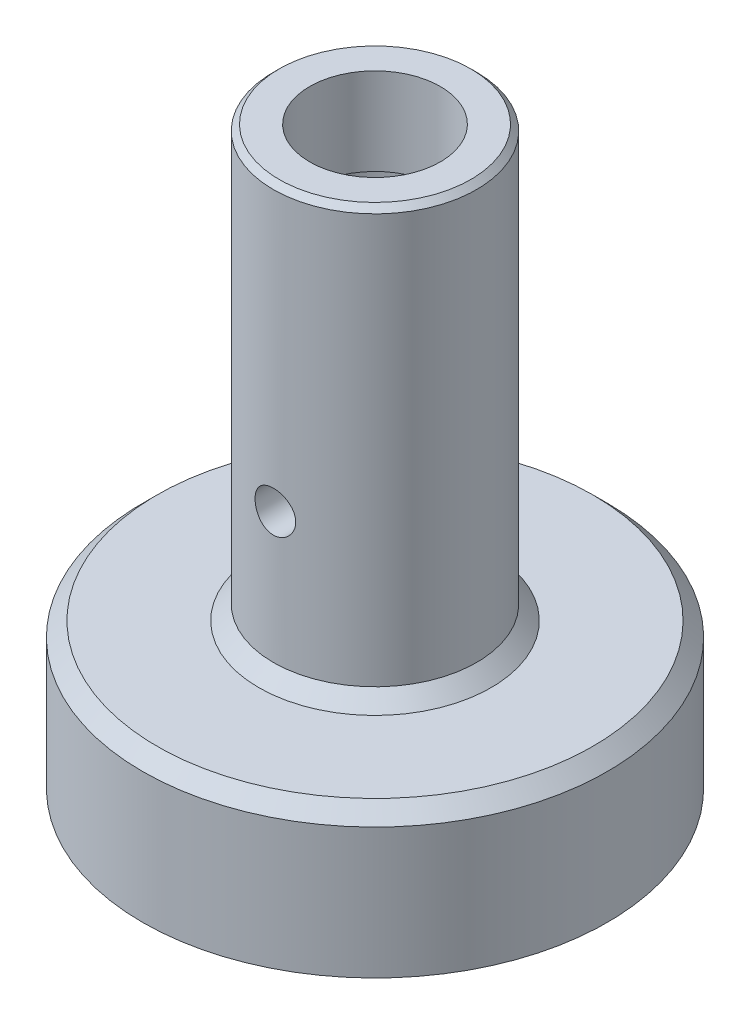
ISO-10303-21;
HEADER;
FILE_DESCRIPTION(('STEP AP214'),'2;1');
FILE_NAME('part.step','',(''),(''),'','','');
FILE_SCHEMA(('AUTOMOTIVE_DESIGN { 1 0 10303 214 1 1 1 1 }'));
ENDSEC;
DATA;
#1=APPLICATION_CONTEXT('core data for automotive mechanical design processes');
#2=APPLICATION_PROTOCOL_DEFINITION('international standard','automotive_design',2000,#1);
#3=PRODUCT_CONTEXT('',#1,'mechanical');
#4=PRODUCT('Part','Part','',(#3));
#5=PRODUCT_RELATED_PRODUCT_CATEGORY('part','',(#4));
#6=PRODUCT_DEFINITION_FORMATION('','',#4);
#7=PRODUCT_DEFINITION_CONTEXT('part definition',#1,'design');
#8=PRODUCT_DEFINITION('design','',#6,#7);
#9=PRODUCT_DEFINITION_SHAPE('','',#8);
#10=(LENGTH_UNIT() NAMED_UNIT(*) SI_UNIT(.MILLI.,.METRE.));
#11=(NAMED_UNIT(*) PLANE_ANGLE_UNIT() SI_UNIT($,.RADIAN.));
#12=(NAMED_UNIT(*) SI_UNIT($,.STERADIAN.) SOLID_ANGLE_UNIT());
#13=UNCERTAINTY_MEASURE_WITH_UNIT(LENGTH_MEASURE(1.E-05),#10,'distance_accuracy_value','');
#14=(GEOMETRIC_REPRESENTATION_CONTEXT(3) GLOBAL_UNCERTAINTY_ASSIGNED_CONTEXT((#13)) GLOBAL_UNIT_ASSIGNED_CONTEXT((#10,
#11,#12)) REPRESENTATION_CONTEXT('',''));
#15=CARTESIAN_POINT('',(0.,0.,0.));
#16=DIRECTION('',(0.,0.,1.));
#17=DIRECTION('',(1.,0.,0.));
#18=AXIS2_PLACEMENT_3D('',#15,#16,#17);
#19=CARTESIAN_POINT('',(0.,66.7925189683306,0.));
#20=DIRECTION('',(0.,1.,0.));
#21=DIRECTION('',(0.,0.,1.));
#22=AXIS2_PLACEMENT_3D('',#19,#20,#21);
#23=CYLINDRICAL_SURFACE('',#22,25.);
#24=CARTESIAN_POINT('',(0.,-30.,0.));
#25=DIRECTION('',(0.,1.,0.));
#26=DIRECTION('',(0.,0.,1.));
#27=AXIS2_PLACEMENT_3D('',#24,#25,#26);
#28=CIRCLE('',#27,25.);
#29=CARTESIAN_POINT('',(0.,-30.,25.));
#30=VERTEX_POINT('',#29);
#31=EDGE_CURVE('E66',#30,#30,#28,.T.);
#32=ORIENTED_EDGE('',*,*,#31,.T.);
#33=EDGE_LOOP('',(#32));
#34=FACE_BOUND('',#33,.T.);
#35=CARTESIAN_POINT('',(0.,-176.,0.));
#36=DIRECTION('',(0.,1.,0.));
#37=DIRECTION('',(0.,0.,1.));
#38=AXIS2_PLACEMENT_3D('',#35,#36,#37);
#39=CIRCLE('',#38,25.);
#40=CARTESIAN_POINT('',(0.,-176.,25.));
#41=VERTEX_POINT('',#40);
#42=EDGE_CURVE('E10',#41,#41,#39,.F.);
#43=ORIENTED_EDGE('',*,*,#42,.T.);
#44=EDGE_LOOP('',(#43));
#45=FACE_BOUND('',#44,.T.);
#46=CARTESIAN_POINT('',(0.,-105.,25.));
#47=CARTESIAN_POINT('',(-0.192641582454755,-105.000007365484,25.0000048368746));
#48=CARTESIAN_POINT('',(-0.385209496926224,-104.992047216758,24.9977704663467));
#49=CARTESIAN_POINT('',(-0.768985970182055,-104.960294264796,24.9889060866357));
#50=CARTESIAN_POINT('',(-0.960194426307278,-104.93650027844,24.982275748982));
#51=CARTESIAN_POINT('',(-1.33983267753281,-104.873274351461,24.9647949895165));
#52=CARTESIAN_POINT('',(-1.52826199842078,-104.833839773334,24.9539438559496));
#53=CARTESIAN_POINT('',(-1.90105420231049,-104.739656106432,24.9283154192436));
#54=CARTESIAN_POINT('',(-2.08541555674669,-104.684901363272,24.9135366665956));
#55=CARTESIAN_POINT('',(-2.44840649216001,-104.560643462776,24.8804836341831));
#56=CARTESIAN_POINT('',(-2.62704559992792,-104.491166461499,24.8622155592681));
#57=CARTESIAN_POINT('',(-2.97781048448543,-104.337925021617,24.8226472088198));
#58=CARTESIAN_POINT('',(-3.14993382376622,-104.254155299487,24.8013458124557));
#59=CARTESIAN_POINT('',(-3.48645233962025,-104.072984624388,24.7562810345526));
#60=CARTESIAN_POINT('',(-3.65084991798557,-103.975587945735,24.7325184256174));
#61=CARTESIAN_POINT('',(-3.97097457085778,-103.767826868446,24.6831449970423));
#62=CARTESIAN_POINT('',(-4.12669829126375,-103.657457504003,24.6575334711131));
#63=CARTESIAN_POINT('',(-4.58613327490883,-103.302742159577,24.5777371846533));
#64=CARTESIAN_POINT('',(-4.87470196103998,-103.038772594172,24.5216246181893));
#65=CARTESIAN_POINT('',(-5.40404439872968,-102.466350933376,24.4104443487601));
#66=CARTESIAN_POINT('',(-5.64481130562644,-102.157892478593,24.3553767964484));
#67=CARTESIAN_POINT('',(-5.96725766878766,-101.664905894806,24.2776517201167));
#68=CARTESIAN_POINT('',(-6.06909441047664,-101.493683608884,24.2523314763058));
#69=CARTESIAN_POINT('',(-6.25792635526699,-101.142923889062,24.2042940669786));
#70=CARTESIAN_POINT('',(-6.34492739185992,-100.963389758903,24.1815758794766));
#71=CARTESIAN_POINT('',(-6.50341953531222,-100.597184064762,24.1394338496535));
#72=CARTESIAN_POINT('',(-6.57490685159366,-100.410510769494,24.1200108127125));
#73=CARTESIAN_POINT('',(-6.70171757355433,-100.031475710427,24.0850848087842));
#74=CARTESIAN_POINT('',(-6.75704789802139,-99.8391164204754,24.0695801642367));
#75=CARTESIAN_POINT('',(-6.84993811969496,-99.4548105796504,24.0433072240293));
#76=CARTESIAN_POINT('',(-6.88789752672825,-99.2629677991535,24.0324328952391));
#77=CARTESIAN_POINT('',(-6.94763745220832,-98.8766517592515,24.0152306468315));
#78=CARTESIAN_POINT('',(-6.96942437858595,-98.6821795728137,24.0089009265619));
#79=CARTESIAN_POINT('',(-6.99664103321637,-98.2919954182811,24.0009836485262));
#80=CARTESIAN_POINT('',(-7.00207059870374,-98.096283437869,23.9993961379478));
#81=CARTESIAN_POINT('',(-6.99652065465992,-97.7051141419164,24.0010147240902));
#82=CARTESIAN_POINT('',(-6.98554144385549,-97.5096568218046,24.0042207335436));
#83=CARTESIAN_POINT('',(-6.94787685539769,-97.1265647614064,24.015148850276));
#84=CARTESIAN_POINT('',(-6.92169271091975,-96.938876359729,24.0227267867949));
#85=CARTESIAN_POINT('',(-6.85423822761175,-96.5663838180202,24.0420599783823));
#86=CARTESIAN_POINT('',(-6.81296274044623,-96.3815806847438,24.0538166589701));
#87=CARTESIAN_POINT('',(-6.71568625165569,-96.0162454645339,24.0811566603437));
#88=CARTESIAN_POINT('',(-6.65968969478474,-95.8357121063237,24.0967388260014));
#89=CARTESIAN_POINT('',(-6.53338774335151,-95.4799834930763,24.1312894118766));
#90=CARTESIAN_POINT('',(-6.46307696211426,-95.3047902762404,24.1502591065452));
#91=CARTESIAN_POINT('',(-6.30777219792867,-94.958885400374,24.1912904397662));
#92=CARTESIAN_POINT('',(-6.22261388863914,-94.7882515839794,24.2133860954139));
#93=CARTESIAN_POINT('',(-6.0387893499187,-94.4546787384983,24.2598847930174));
#94=CARTESIAN_POINT('',(-5.94011848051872,-94.2917423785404,24.2842886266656));
#95=CARTESIAN_POINT('',(-5.72996540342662,-93.9746205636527,24.3347317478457));
#96=CARTESIAN_POINT('',(-5.61848308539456,-93.8204351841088,24.3607710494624));
#97=CARTESIAN_POINT('',(-5.38343075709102,-93.5217422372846,24.4137908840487));
#98=CARTESIAN_POINT('',(-5.25986045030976,-93.3772349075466,24.4407714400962));
#99=CARTESIAN_POINT('',(-4.99670237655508,-93.0937060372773,24.4959524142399));
#100=CARTESIAN_POINT('',(-4.8566957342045,-92.9550746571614,24.5241615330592));
#101=CARTESIAN_POINT('',(-4.56548871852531,-92.6900984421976,24.580038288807));
#102=CARTESIAN_POINT('',(-4.41429201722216,-92.5637496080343,24.6077060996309));
#103=CARTESIAN_POINT('',(-4.10157168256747,-92.3240919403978,24.6617577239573));
#104=CARTESIAN_POINT('',(-3.94004368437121,-92.2107886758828,24.688140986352));
#105=CARTESIAN_POINT('',(-3.60783553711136,-91.9981333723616,24.7388710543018));
#106=CARTESIAN_POINT('',(-3.43715899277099,-91.8987758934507,24.7632186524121));
#107=CARTESIAN_POINT('',(-3.08674710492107,-91.714188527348,24.8093407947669));
#108=CARTESIAN_POINT('',(-2.90696623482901,-91.6290411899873,24.8311001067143));
#109=CARTESIAN_POINT('',(-2.54055533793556,-91.4742728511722,24.8712590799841));
#110=CARTESIAN_POINT('',(-2.35392792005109,-91.4046460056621,24.8896600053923));
#111=CARTESIAN_POINT('',(-1.97510428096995,-91.2814710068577,24.9225822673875));
#112=CARTESIAN_POINT('',(-1.78290808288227,-91.2279227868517,24.9371036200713));
#113=CARTESIAN_POINT('',(-1.39438339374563,-91.1373854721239,24.9618424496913));
#114=CARTESIAN_POINT('',(-1.19805503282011,-91.1003958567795,24.9720600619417));
#115=CARTESIAN_POINT('',(-0.809028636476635,-91.0442205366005,24.9876402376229));
#116=CARTESIAN_POINT('',(-0.616412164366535,-91.0245087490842,24.9931461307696));
#117=CARTESIAN_POINT('',(-0.230133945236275,-91.0011089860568,24.9996869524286));
#118=CARTESIAN_POINT('',(-0.0364722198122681,-90.9974206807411,25.000721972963));
#119=CARTESIAN_POINT('',(0.350441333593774,-91.00610035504,24.9982922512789));
#120=CARTESIAN_POINT('',(0.543693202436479,-91.0184666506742,24.9948279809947));
#121=CARTESIAN_POINT('',(0.928379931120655,-91.0591412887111,24.9834973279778));
#122=CARTESIAN_POINT('',(1.1198148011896,-91.0874495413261,24.9756309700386));
#123=CARTESIAN_POINT('',(1.49577857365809,-91.1590532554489,24.9559090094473));
#124=CARTESIAN_POINT('',(1.68036937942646,-91.2020465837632,24.9441339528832));
#125=CARTESIAN_POINT('',(2.04526565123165,-91.3027822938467,24.9168692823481));
#126=CARTESIAN_POINT('',(2.22556965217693,-91.3605296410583,24.9013784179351));
#127=CARTESIAN_POINT('',(2.58058397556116,-91.4902921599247,24.8670944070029));
#128=CARTESIAN_POINT('',(2.75529581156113,-91.5623034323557,24.8483021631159));
#129=CARTESIAN_POINT('',(3.0981243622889,-91.7200917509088,24.8078905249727));
#130=CARTESIAN_POINT('',(3.26623856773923,-91.8058739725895,24.7862700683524));
#131=CARTESIAN_POINT('',(3.59816233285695,-91.9924861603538,24.7402885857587));
#132=CARTESIAN_POINT('',(3.76181102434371,-92.0935905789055,24.7158801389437));
#133=CARTESIAN_POINT('',(4.08011150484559,-92.3088126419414,24.6653334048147));
#134=CARTESIAN_POINT('',(4.23476015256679,-92.4229347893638,24.6391945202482));
#135=CARTESIAN_POINT('',(4.53405202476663,-92.663407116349,24.5858797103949));
#136=CARTESIAN_POINT('',(4.67869501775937,-92.789757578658,24.5587037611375));
#137=CARTESIAN_POINT('',(4.95708489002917,-93.0538776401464,24.5040289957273));
#138=CARTESIAN_POINT('',(5.09083159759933,-93.1916474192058,24.4765301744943));
#139=CARTESIAN_POINT('',(5.35063368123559,-93.4822687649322,24.4210752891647));
#140=CARTESIAN_POINT('',(5.47631328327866,-93.6354590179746,24.3931321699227));
#141=CARTESIAN_POINT('',(5.71429075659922,-93.9520276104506,24.3384836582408));
#142=CARTESIAN_POINT('',(5.82659317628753,-94.1154024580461,24.3117778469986));
#143=CARTESIAN_POINT('',(6.03710305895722,-94.4513807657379,24.2603614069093));
#144=CARTESIAN_POINT('',(6.13530536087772,-94.6239875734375,24.2356515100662));
#145=CARTESIAN_POINT('',(6.31678429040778,-94.9771482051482,24.1889854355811));
#146=CARTESIAN_POINT('',(6.40006698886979,-95.1576987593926,24.1670281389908));
#147=CARTESIAN_POINT('',(6.55069471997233,-95.5246163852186,24.126633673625));
#148=CARTESIAN_POINT('',(6.61811962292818,-95.7109487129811,24.1081789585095));
#149=CARTESIAN_POINT('',(6.7369845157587,-96.0889092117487,24.0752330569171));
#150=CARTESIAN_POINT('',(6.78843079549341,-96.2805352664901,24.0607403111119));
#151=CARTESIAN_POINT('',(6.87491079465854,-96.6677280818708,24.0361732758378));
#152=CARTESIAN_POINT('',(6.90994524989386,-96.8632946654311,24.0260987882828));
#153=CARTESIAN_POINT('',(6.96327565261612,-97.2568803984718,24.0106969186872));
#154=CARTESIAN_POINT('',(6.98157213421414,-97.4548994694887,24.0053693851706));
#155=CARTESIAN_POINT('',(7.00089410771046,-97.8446078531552,23.9997411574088));
#156=CARTESIAN_POINT('',(7.00252465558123,-98.0362648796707,23.9992643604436));
#157=CARTESIAN_POINT('',(6.99006805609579,-98.4190912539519,24.0028954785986));
#158=CARTESIAN_POINT('',(6.97597551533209,-98.610260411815,24.0070049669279));
#159=CARTESIAN_POINT('',(6.93219935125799,-98.9905743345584,24.0196821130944));
#160=CARTESIAN_POINT('',(6.90252205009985,-99.1797198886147,24.0282479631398));
#161=CARTESIAN_POINT('',(6.82782649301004,-99.5547871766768,24.0495798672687));
#162=CARTESIAN_POINT('',(6.78280251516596,-99.7407076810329,24.0623474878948));
#163=CARTESIAN_POINT('',(6.67831208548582,-100.106160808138,24.0915557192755));
#164=CARTESIAN_POINT('',(6.61899152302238,-100.285738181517,24.107959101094));
#165=CARTESIAN_POINT('',(6.48612970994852,-100.639279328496,24.1440439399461));
#166=CARTESIAN_POINT('',(6.41258362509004,-100.813241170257,24.1637265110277));
#167=CARTESIAN_POINT('',(6.25183518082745,-101.154379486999,24.2058144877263));
#168=CARTESIAN_POINT('',(6.1646334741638,-101.321556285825,24.2282197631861));
#169=CARTESIAN_POINT('',(5.97718067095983,-101.648117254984,24.2751445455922));
#170=CARTESIAN_POINT('',(5.87692912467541,-101.807501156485,24.299664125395));
#171=CARTESIAN_POINT('',(5.66059342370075,-102.122543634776,24.3509842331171));
#172=CARTESIAN_POINT('',(5.5441019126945,-102.27791476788,24.3778328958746));
#173=CARTESIAN_POINT('',(5.29873874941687,-102.578315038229,24.432338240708));
#174=CARTESIAN_POINT('',(5.16987093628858,-102.723347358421,24.459994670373));
#175=CARTESIAN_POINT('',(4.90047472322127,-103.00229597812,24.5153883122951));
#176=CARTESIAN_POINT('',(4.75993957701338,-103.136205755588,24.5431255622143));
#177=CARTESIAN_POINT('',(4.46821353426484,-103.391908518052,24.5979081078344));
#178=CARTESIAN_POINT('',(4.31702647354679,-103.513705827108,24.6249536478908));
#179=CARTESIAN_POINT('',(4.00102956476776,-103.747287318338,24.6782912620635));
#180=CARTESIAN_POINT('',(3.83597515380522,-103.858749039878,24.7045481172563));
#181=CARTESIAN_POINT('',(3.49678582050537,-104.067298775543,24.7548353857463));
#182=CARTESIAN_POINT('',(3.32265425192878,-104.164392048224,24.7788666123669));
#183=CARTESIAN_POINT('',(2.96648019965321,-104.343476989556,24.8240243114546));
#184=CARTESIAN_POINT('',(2.78444010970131,-104.42547318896,24.8451516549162));
#185=CARTESIAN_POINT('',(2.41375662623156,-104.573709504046,24.8839017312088));
#186=CARTESIAN_POINT('',(2.22511402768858,-104.639951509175,24.9015248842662));
#187=CARTESIAN_POINT('',(1.70543781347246,-104.797723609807,24.9439296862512));
#188=CARTESIAN_POINT('',(1.3691206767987,-104.873422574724,24.9648079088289));
#189=CARTESIAN_POINT('',(0.688456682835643,-104.974551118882,24.9928379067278));
#190=CARTESIAN_POINT('',(0.344110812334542,-104.999986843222,24.9999913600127));
#191=CARTESIAN_POINT('',(0.,-105.,25.));
#192=B_SPLINE_CURVE_WITH_KNOTS('',3,(#46,#47,#48,#49,#50,#51,#52,#53,#54,#55,#56,#57,#58,#59,
#60,#61,#62,#63,#64,#65,#66,#67,#68,#69,#70,#71,#72,#73,#74,#75,#76,#77,#78,#79,#80,#81,#82,#83,
#84,#85,#86,#87,#88,#89,#90,#91,#92,#93,#94,#95,#96,#97,#98,#99,#100,#101,#102,#103,#104,#105,
#106,#107,#108,#109,#110,#111,#112,#113,#114,#115,#116,#117,#118,#119,#120,#121,#122,#123,#124,
#125,#126,#127,#128,#129,#130,#131,#132,#133,#134,#135,#136,#137,#138,#139,#140,#141,#142,#143,
#144,#145,#146,#147,#148,#149,#150,#151,#152,#153,#154,#155,#156,#157,#158,#159,#160,#161,#162,
#163,#164,#165,#166,#167,#168,#169,#170,#171,#172,#173,#174,#175,#176,#177,#178,#179,#180,#181,
#182,#183,#184,#185,#186,#187,#188,#189,#190,#191),.UNSPECIFIED.,.T.,.F.,(4,2,2,2,2,2,2,2,2,2,2,
2,2,2,2,2,2,2,2,2,2,2,2,2,2,2,2,2,2,2,2,2,2,2,2,2,2,2,2,2,2,2,2,2,2,2,2,2,2,2,2,2,2,2,2,2,2,2,2,
2,2,2,2,2,2,2,2,2,2,2,2,2,4),(0.,0.577620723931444,1.15528461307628,1.73304595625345,
2.31102082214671,2.88797732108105,3.46514756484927,4.04213717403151,4.61934837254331,
5.798883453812,6.97858730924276,7.58042928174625,8.18203405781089,8.78378566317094,
9.38527920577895,9.97214207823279,10.5587722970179,11.1454083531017,11.7320337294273,
12.3003380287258,12.8688363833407,13.4371632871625,14.0057044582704,14.5809917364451,
15.1564770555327,15.7319673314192,16.3074717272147,16.9038889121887,17.5001112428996,
18.0965871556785,18.6928297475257,19.2924237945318,19.8917916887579,20.491157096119,
21.090503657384,21.6708947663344,22.2512739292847,22.8315922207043,23.4119072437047,
23.9809379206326,24.5501603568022,25.1192274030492,25.6885088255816,26.2695605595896,
26.8508138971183,27.4320806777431,28.0133566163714,28.6129711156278,29.2123811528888,
29.812010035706,30.4113943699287,31.0076918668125,31.6037543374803,32.1997900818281,
32.7958068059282,33.3701048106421,33.9445998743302,34.5188620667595,35.0933386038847,
35.6621841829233,36.2312234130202,36.8002354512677,37.369267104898,37.9567122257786,
38.5439757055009,39.1315811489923,39.7189760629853,40.3209099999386,40.9226230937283,
41.5241553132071,42.1256153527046,43.1575308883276,44.1893202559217),.UNSPECIFIED.);
#193=CARTESIAN_POINT('',(0.,-105.,25.));
#194=VERTEX_POINT('',#193);
#195=EDGE_CURVE('E90',#194,#194,#192,.T.);
#196=ORIENTED_EDGE('',*,*,#195,.F.);
#197=EDGE_LOOP('',(#196));
#198=FACE_BOUND('',#197,.T.);
#199=ADVANCED_FACE('F30',(#34,#45,#198),#23,.F.);
#200=CARTESIAN_POINT('',(0.,66.7925189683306,0.));
#201=DIRECTION('',(0.,1.,0.));
#202=DIRECTION('',(0.,0.,1.));
#203=AXIS2_PLACEMENT_3D('',#200,#201,#202);
#204=CYLINDRICAL_SURFACE('',#203,35.);
#205=CARTESIAN_POINT('',(0.,-143.,0.));
#206=DIRECTION('',(0.,-1.,0.));
#207=DIRECTION('',(0.,0.,-1.));
#208=AXIS2_PLACEMENT_3D('',#205,#206,#207);
#209=CIRCLE('',#208,35.);
#210=CARTESIAN_POINT('',(0.,-143.,-35.));
#211=VERTEX_POINT('',#210);
#212=EDGE_CURVE('E57',#211,#211,#209,.F.);
#213=ORIENTED_EDGE('',*,*,#212,.T.);
#214=EDGE_LOOP('',(#213));
#215=FACE_BOUND('',#214,.T.);
#216=CARTESIAN_POINT('',(0.,-2.00000000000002,0.));
#217=DIRECTION('',(0.,-1.,0.));
#218=DIRECTION('',(0.,0.,-1.));
#219=AXIS2_PLACEMENT_3D('',#216,#217,#218);
#220=CIRCLE('',#219,35.);
#221=CARTESIAN_POINT('',(0.,-2.00000000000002,-35.));
#222=VERTEX_POINT('',#221);
#223=EDGE_CURVE('E46',#222,#222,#220,.T.);
#224=ORIENTED_EDGE('',*,*,#223,.T.);
#225=EDGE_LOOP('',(#224));
#226=FACE_BOUND('',#225,.T.);
#227=CARTESIAN_POINT('',(0.,-105.,35.));
#228=CARTESIAN_POINT('',(0.194584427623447,-105.00000387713,35.0000019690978));
#229=CARTESIAN_POINT('',(0.389120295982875,-104.991884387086,34.9983744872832));
#230=CARTESIAN_POINT('',(0.776845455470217,-104.959478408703,34.9919142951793));
#231=CARTESIAN_POINT('',(0.970034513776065,-104.935189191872,34.9870810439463));
#232=CARTESIAN_POINT('',(1.35371201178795,-104.870614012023,34.9743383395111));
#233=CARTESIAN_POINT('',(1.54419900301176,-104.830319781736,34.9664272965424));
#234=CARTESIAN_POINT('',(1.92109552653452,-104.734035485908,34.9477467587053));
#235=CARTESIAN_POINT('',(2.10750353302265,-104.678039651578,34.9369762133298));
#236=CARTESIAN_POINT('',(2.47461647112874,-104.550874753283,34.91289262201));
#237=CARTESIAN_POINT('',(2.65532872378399,-104.479726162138,34.8995830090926));
#238=CARTESIAN_POINT('',(3.01013996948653,-104.322713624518,34.8707721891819));
#239=CARTESIAN_POINT('',(3.18423649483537,-104.236844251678,34.8552701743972));
#240=CARTESIAN_POINT('',(3.5244969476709,-104.051072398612,34.8225088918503));
#241=CARTESIAN_POINT('',(3.69066438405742,-103.951176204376,34.80525041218));
#242=CARTESIAN_POINT('',(4.01410828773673,-103.737984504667,34.7694323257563));
#243=CARTESIAN_POINT('',(4.17138140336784,-103.6246839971,34.7508722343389));
#244=CARTESIAN_POINT('',(4.47772994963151,-103.384079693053,34.7127360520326));
#245=CARTESIAN_POINT('',(4.62668711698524,-103.256626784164,34.6931505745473));
#246=CARTESIAN_POINT('',(4.91342597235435,-102.98965265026,34.6537040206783));
#247=CARTESIAN_POINT('',(5.05120349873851,-102.850126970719,34.6338428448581));
#248=CARTESIAN_POINT('',(5.3145529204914,-102.560032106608,34.5944107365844));
#249=CARTESIAN_POINT('',(5.44012832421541,-102.409466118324,34.5748397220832));
#250=CARTESIAN_POINT('',(5.67830086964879,-102.098208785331,34.5365235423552));
#251=CARTESIAN_POINT('',(5.7908932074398,-101.937513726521,34.5177786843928));
#252=CARTESIAN_POINT('',(6.00320113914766,-101.605651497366,34.4814918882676));
#253=CARTESIAN_POINT('',(6.10279264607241,-101.434403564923,34.4639621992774));
#254=CARTESIAN_POINT('',(6.28717262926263,-101.083936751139,34.4308036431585));
#255=CARTESIAN_POINT('',(6.37196103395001,-100.90471783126,34.4151747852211));
#256=CARTESIAN_POINT('',(6.52608373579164,-100.539585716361,34.3862818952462));
#257=CARTESIAN_POINT('',(6.59541937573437,-100.353673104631,34.373017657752));
#258=CARTESIAN_POINT('',(6.71810267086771,-99.976469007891,34.3492504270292));
#259=CARTESIAN_POINT('',(6.77145019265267,-99.7851774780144,34.338747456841));
#260=CARTESIAN_POINT('',(6.86112474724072,-99.4011852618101,34.3209415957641));
#261=CARTESIAN_POINT('',(6.89766855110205,-99.2085370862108,34.3135980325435));
#262=CARTESIAN_POINT('',(6.95448711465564,-98.820695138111,34.3021274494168));
#263=CARTESIAN_POINT('',(6.97475625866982,-98.6255005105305,34.2980015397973));
#264=CARTESIAN_POINT('',(6.9988271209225,-98.234131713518,34.2930982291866));
#265=CARTESIAN_POINT('',(7.00263630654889,-98.0379580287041,34.2923193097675));
#266=CARTESIAN_POINT('',(6.99379550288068,-97.6459776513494,34.2941217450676));
#267=CARTESIAN_POINT('',(6.98113947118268,-97.4501711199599,34.2967043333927));
#268=CARTESIAN_POINT('',(6.91918161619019,-96.8715058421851,34.3092860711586));
#269=CARTESIAN_POINT('',(6.84626967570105,-96.4909927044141,34.3240437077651));
#270=CARTESIAN_POINT('',(6.63906529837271,-95.7479249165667,34.3647162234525));
#271=CARTESIAN_POINT('',(6.50476993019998,-95.385371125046,34.3906316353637));
#272=CARTESIAN_POINT('',(6.17767345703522,-94.6854100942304,34.4508938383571));
#273=CARTESIAN_POINT('',(5.984483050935,-94.3481893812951,34.4852964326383));
#274=CARTESIAN_POINT('',(5.54535502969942,-93.7105995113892,34.5586231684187));
#275=CARTESIAN_POINT('',(5.29941135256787,-93.4102345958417,34.5975478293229));
#276=CARTESIAN_POINT('',(4.75649953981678,-92.8491954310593,34.6763915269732));
#277=CARTESIAN_POINT('',(4.45869312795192,-92.5893323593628,34.7163158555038));
#278=CARTESIAN_POINT('',(3.82329516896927,-92.1231227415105,34.7920193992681));
#279=CARTESIAN_POINT('',(3.48570311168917,-91.9167768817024,34.8277985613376));
#280=CARTESIAN_POINT('',(2.77941570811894,-91.5633075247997,34.8912683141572));
#281=CARTESIAN_POINT('',(2.41067273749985,-91.4162767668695,34.9189462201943));
#282=CARTESIAN_POINT('',(1.65304283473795,-91.1864766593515,34.9629986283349));
#283=CARTESIAN_POINT('',(1.26415834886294,-91.1036995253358,34.9793744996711));
#284=CARTESIAN_POINT('',(0.484255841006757,-91.0059048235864,34.9987870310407));
#285=CARTESIAN_POINT('',(0.093382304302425,-90.9897770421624,35.0020422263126));
#286=CARTESIAN_POINT('',(-0.685474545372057,-91.0227490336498,34.9954536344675));
#287=CARTESIAN_POINT('',(-1.07345801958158,-91.0718451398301,34.9856105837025));
#288=CARTESIAN_POINT('',(-1.83193959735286,-91.2329485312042,34.9540682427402));
#289=CARTESIAN_POINT('',(-2.20256355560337,-91.3443861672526,34.9324763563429));
#290=CARTESIAN_POINT('',(-2.91986547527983,-91.6263881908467,34.8798486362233));
#291=CARTESIAN_POINT('',(-3.26654164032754,-91.796957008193,34.8488120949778));
#292=CARTESIAN_POINT('',(-3.93078790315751,-92.194776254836,34.7801938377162));
#293=CARTESIAN_POINT('',(-4.24794971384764,-92.4226950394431,34.7425366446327));
#294=CARTESIAN_POINT('',(-4.83992730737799,-92.9278687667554,34.6650313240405));
#295=CARTESIAN_POINT('',(-5.11473854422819,-93.2051289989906,34.6251829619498));
#296=CARTESIAN_POINT('',(-5.61847968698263,-93.8060966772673,34.5470516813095));
#297=CARTESIAN_POINT('',(-5.84664719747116,-94.130447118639,34.5088018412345));
#298=CARTESIAN_POINT('',(-6.24531465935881,-94.8137426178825,34.4388918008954));
#299=CARTESIAN_POINT('',(-6.41581691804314,-95.1726862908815,34.4072313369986));
#300=CARTESIAN_POINT('',(-6.62396362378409,-95.727969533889,34.3675418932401));
#301=CARTESIAN_POINT('',(-6.68533231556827,-95.9154649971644,34.3556291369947));
#302=CARTESIAN_POINT('',(-6.7920623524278,-96.2950979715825,34.3346891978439));
#303=CARTESIAN_POINT('',(-6.83742956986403,-96.4872337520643,34.3256609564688));
#304=CARTESIAN_POINT('',(-6.9117883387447,-96.8747732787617,34.3107652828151));
#305=CARTESIAN_POINT('',(-6.94077850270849,-97.0701773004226,34.304898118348));
#306=CARTESIAN_POINT('',(-6.98214719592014,-97.4628053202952,34.2965023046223));
#307=CARTESIAN_POINT('',(-6.99452634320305,-97.6600292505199,34.2939735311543));
#308=CARTESIAN_POINT('',(-7.00249657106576,-98.0512455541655,34.2923468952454));
#309=CARTESIAN_POINT('',(-6.99838818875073,-98.2452316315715,34.2931876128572));
#310=CARTESIAN_POINT('',(-6.97409200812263,-98.6321492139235,34.2981368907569));
#311=CARTESIAN_POINT('',(-6.95390451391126,-98.8250807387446,34.3022453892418));
#312=CARTESIAN_POINT('',(-6.89760690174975,-99.2085444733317,34.3136101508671));
#313=CARTESIAN_POINT('',(-6.86149408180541,-99.3990762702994,34.320866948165));
#314=CARTESIAN_POINT('',(-6.77364545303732,-99.7762929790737,34.3383128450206));
#315=CARTESIAN_POINT('',(-6.7219152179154,-99.962979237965,34.348500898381));
#316=CARTESIAN_POINT('',(-6.60334929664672,-100.330891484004,34.3714912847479));
#317=CARTESIAN_POINT('',(-6.53654539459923,-100.512128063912,34.3842881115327));
#318=CARTESIAN_POINT('',(-6.3882952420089,-100.868252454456,34.4121398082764));
#319=CARTESIAN_POINT('',(-6.30685417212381,-101.043142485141,34.4271938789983));
#320=CARTESIAN_POINT('',(-6.12986392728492,-101.385546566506,34.4591476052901));
#321=CARTESIAN_POINT('',(-6.03430889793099,-101.553057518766,34.4760480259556));
#322=CARTESIAN_POINT('',(-5.829819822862,-101.879468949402,34.5112149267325));
#323=CARTESIAN_POINT('',(-5.72089036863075,-102.038372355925,34.5294809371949));
#324=CARTESIAN_POINT('',(-5.48836215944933,-102.349277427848,34.56720973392));
#325=CARTESIAN_POINT('',(-5.36454154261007,-102.501111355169,34.5866877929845));
#326=CARTESIAN_POINT('',(-5.10468677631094,-102.793793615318,34.6259935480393));
#327=CARTESIAN_POINT('',(-4.96865693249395,-102.934645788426,34.6458211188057));
#328=CARTESIAN_POINT('',(-4.68518010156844,-103.2045568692,34.6852933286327));
#329=CARTESIAN_POINT('',(-4.53772640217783,-103.33360874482,34.7049378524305));
#330=CARTESIAN_POINT('',(-4.23251890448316,-103.578897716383,34.7434803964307));
#331=CARTESIAN_POINT('',(-4.07476891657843,-103.69513951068,34.7623786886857));
#332=CARTESIAN_POINT('',(-3.74821071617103,-103.915243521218,34.7991120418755));
#333=CARTESIAN_POINT('',(-3.5793009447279,-104.018957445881,34.8169333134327));
#334=CARTESIAN_POINT('',(-3.23322252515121,-104.211722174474,34.8507745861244));
#335=CARTESIAN_POINT('',(-3.05605695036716,-104.30077837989,34.8667952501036));
#336=CARTESIAN_POINT('',(-2.69475265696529,-104.46355430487,34.8965775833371));
#337=CARTESIAN_POINT('',(-2.51061823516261,-104.53728329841,34.910340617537));
#338=CARTESIAN_POINT('',(-2.13665819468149,-104.668882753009,34.9352234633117));
#339=CARTESIAN_POINT('',(-1.94683368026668,-104.72675626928,34.9463437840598));
#340=CARTESIAN_POINT('',(-1.46888301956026,-104.850512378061,34.9703322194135));
#341=CARTESIAN_POINT('',(-1.1780404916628,-104.906493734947,34.9813998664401));
#342=CARTESIAN_POINT('',(-0.59142783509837,-104.981234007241,34.9962321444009));
#343=CARTESIAN_POINT('',(-0.295657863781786,-104.999994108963,34.9999970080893));
#344=CARTESIAN_POINT('',(0.,-105.,35.));
#345=B_SPLINE_CURVE_WITH_KNOTS('',3,(#227,#228,#229,#230,#231,#232,#233,#234,#235,#236,#237,
#238,#239,#240,#241,#242,#243,#244,#245,#246,#247,#248,#249,#250,#251,#252,#253,#254,#255,#256,
#257,#258,#259,#260,#261,#262,#263,#264,#265,#266,#267,#268,#269,#270,#271,#272,#273,#274,#275,
#276,#277,#278,#279,#280,#281,#282,#283,#284,#285,#286,#287,#288,#289,#290,#291,#292,#293,#294,
#295,#296,#297,#298,#299,#300,#301,#302,#303,#304,#305,#306,#307,#308,#309,#310,#311,#312,#313,
#314,#315,#316,#317,#318,#319,#320,#321,#322,#323,#324,#325,#326,#327,#328,#329,#330,#331,#332,
#333,#334,#335,#336,#337,#338,#339,#340,#341,#342,#343,#344),.UNSPECIFIED.,.T.,.F.,(4,2,2,2,2,2,
2,2,2,2,2,2,2,2,2,2,2,2,2,2,2,2,2,2,2,2,2,2,2,2,2,2,2,2,2,2,2,2,2,2,2,2,2,2,2,2,2,2,2,2,2,2,2,2,
2,2,2,2,4),(0.,0.583493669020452,1.16708582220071,1.75097981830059,2.33508861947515,
2.91841318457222,3.5019532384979,4.08523261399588,4.66873034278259,5.25909530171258,
5.84967902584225,6.44009243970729,7.03072361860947,7.62663385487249,8.22254697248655,
8.81840828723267,9.41427457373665,10.002222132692,10.590372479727,11.178255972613,
11.7663552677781,12.9235408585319,14.0807817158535,15.2458442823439,16.4110408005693,
17.5971976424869,18.7833696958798,19.9713892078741,21.1592647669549,22.3272714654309,
23.4952125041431,24.652651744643,25.8101777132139,26.9818745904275,28.1536971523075,
29.3433639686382,30.532983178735,31.1253165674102,31.7174323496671,32.3095982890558,
32.9017421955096,33.4831418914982,34.0645305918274,34.646017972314,35.22729807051,
35.8073637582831,36.3872245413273,36.9673265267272,37.5472299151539,38.137202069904,
38.7269669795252,39.3170810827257,39.9069780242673,40.503286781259,41.0993752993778,
41.695102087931,42.2907140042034,43.1773213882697,44.0639005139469),.UNSPECIFIED.);
#346=CARTESIAN_POINT('',(0.,-105.,35.));
#347=VERTEX_POINT('',#346);
#348=EDGE_CURVE('E34',#347,#347,#345,.T.);
#349=ORIENTED_EDGE('',*,*,#348,.F.);
#350=EDGE_LOOP('',(#349));
#351=FACE_BOUND('',#350,.T.);
#352=ADVANCED_FACE('F129',(#215,#226,#351),#204,.T.);
#353=CARTESIAN_POINT('',(25.,-178.,0.));
#354=DIRECTION('',(0.,1.,0.));
#355=DIRECTION('',(0.,0.,1.));
#356=AXIS2_PLACEMENT_3D('',#353,#354,#355);
#357=PLANE('',#356);
#358=CARTESIAN_POINT('',(0.,-178.,0.));
#359=DIRECTION('',(0.,1.,0.));
#360=DIRECTION('',(0.,0.,1.));
#361=AXIS2_PLACEMENT_3D('',#358,#359,#360);
#362=CIRCLE('',#361,27.);
#363=CARTESIAN_POINT('',(0.,-178.,27.));
#364=VERTEX_POINT('',#363);
#365=EDGE_CURVE('E42',#364,#364,#362,.T.);
#366=ORIENTED_EDGE('',*,*,#365,.T.);
#367=EDGE_LOOP('',(#366));
#368=FACE_BOUND('',#367,.T.);
#369=CARTESIAN_POINT('',(0.,-178.,0.));
#370=DIRECTION('',(0.,1.,0.));
#371=DIRECTION('',(0.,0.,1.));
#372=AXIS2_PLACEMENT_3D('',#369,#370,#371);
#373=CIRCLE('',#372,35.);
#374=CARTESIAN_POINT('',(0.,-178.,35.));
#375=VERTEX_POINT('',#374);
#376=EDGE_CURVE('E87',#375,#375,#373,.T.);
#377=ORIENTED_EDGE('',*,*,#376,.F.);
#378=EDGE_LOOP('',(#377));
#379=FACE_BOUND('',#378,.T.);
#380=ADVANCED_FACE('F133',(#368,#379),#357,.F.);
#381=CARTESIAN_POINT('',(25.,-30.,0.));
#382=DIRECTION('',(0.,1.,0.));
#383=DIRECTION('',(0.,0.,1.));
#384=AXIS2_PLACEMENT_3D('',#381,#382,#383);
#385=PLANE('',#384);
#386=ORIENTED_EDGE('',*,*,#31,.F.);
#387=EDGE_LOOP('',(#386));
#388=FACE_BOUND('',#387,.T.);
#389=CARTESIAN_POINT('',(0.,-30.,0.));
#390=DIRECTION('',(0.,1.,0.));
#391=DIRECTION('',(0.,0.,1.));
#392=AXIS2_PLACEMENT_3D('',#389,#390,#391);
#393=CIRCLE('',#392,22.5);
#394=CARTESIAN_POINT('',(0.,-30.,22.5));
#395=VERTEX_POINT('',#394);
#396=EDGE_CURVE('E69',#395,#395,#393,.T.);
#397=ORIENTED_EDGE('',*,*,#396,.T.);
#398=EDGE_LOOP('',(#397));
#399=FACE_BOUND('',#398,.T.);
#400=ADVANCED_FACE('F140',(#388,#399),#385,.F.);
#401=CARTESIAN_POINT('',(0.,66.7925189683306,0.));
#402=DIRECTION('',(0.,1.,0.));
#403=DIRECTION('',(0.,0.,1.));
#404=AXIS2_PLACEMENT_3D('',#401,#402,#403);
#405=CYLINDRICAL_SURFACE('',#404,22.5);
#406=ORIENTED_EDGE('',*,*,#396,.F.);
#407=EDGE_LOOP('',(#406));
#408=FACE_BOUND('',#407,.T.);
#409=CARTESIAN_POINT('',(0.,0.,0.));
#410=DIRECTION('',(0.,1.,0.));
#411=DIRECTION('',(0.,0.,1.));
#412=AXIS2_PLACEMENT_3D('',#409,#410,#411);
#413=CIRCLE('',#412,22.5);
#414=CARTESIAN_POINT('',(0.,0.,22.5));
#415=VERTEX_POINT('',#414);
#416=EDGE_CURVE('E72',#415,#415,#413,.T.);
#417=ORIENTED_EDGE('',*,*,#416,.T.);
#418=EDGE_LOOP('',(#417));
#419=FACE_BOUND('',#418,.T.);
#420=ADVANCED_FACE('F137',(#408,#419),#405,.F.);
#421=CARTESIAN_POINT('',(22.5,0.,0.));
#422=DIRECTION('',(0.,-1.,0.));
#423=DIRECTION('',(0.,0.,-1.));
#424=AXIS2_PLACEMENT_3D('',#421,#422,#423);
#425=PLANE('',#424);
#426=CARTESIAN_POINT('',(0.,0.,0.));
#427=DIRECTION('',(0.,-1.,0.));
#428=DIRECTION('',(0.,0.,-1.));
#429=AXIS2_PLACEMENT_3D('',#426,#427,#428);
#430=CIRCLE('',#429,33.);
#431=CARTESIAN_POINT('',(0.,0.,-33.));
#432=VERTEX_POINT('',#431);
#433=EDGE_CURVE('E51',#432,#432,#430,.F.);
#434=ORIENTED_EDGE('',*,*,#433,.T.);
#435=EDGE_LOOP('',(#434));
#436=FACE_BOUND('',#435,.T.);
#437=ORIENTED_EDGE('',*,*,#416,.F.);
#438=EDGE_LOOP('',(#437));
#439=FACE_BOUND('',#438,.T.);
#440=ADVANCED_FACE('F127',(#436,#439),#425,.F.);
#441=CARTESIAN_POINT('',(35.,-148.,0.));
#442=DIRECTION('',(0.,-1.,0.));
#443=DIRECTION('',(0.,0.,-1.));
#444=AXIS2_PLACEMENT_3D('',#441,#442,#443);
#445=PLANE('',#444);
#446=CARTESIAN_POINT('',(0.,-148.,0.));
#447=DIRECTION('',(0.,-1.,0.));
#448=DIRECTION('',(0.,0.,-1.));
#449=AXIS2_PLACEMENT_3D('',#446,#447,#448);
#450=CIRCLE('',#449,40.);
#451=CARTESIAN_POINT('',(0.,-148.,-40.));
#452=VERTEX_POINT('',#451);
#453=EDGE_CURVE('E54',#452,#452,#450,.T.);
#454=ORIENTED_EDGE('',*,*,#453,.T.);
#455=EDGE_LOOP('',(#454));
#456=FACE_BOUND('',#455,.T.);
#457=CARTESIAN_POINT('',(0.,-148.,0.));
#458=DIRECTION('',(0.,-1.,0.));
#459=DIRECTION('',(0.,0.,-1.));
#460=AXIS2_PLACEMENT_3D('',#457,#458,#459);
#461=CIRCLE('',#460,75.);
#462=CARTESIAN_POINT('',(0.,-148.,-75.));
#463=VERTEX_POINT('',#462);
#464=EDGE_CURVE('E63',#463,#463,#461,.F.);
#465=ORIENTED_EDGE('',*,*,#464,.T.);
#466=EDGE_LOOP('',(#465));
#467=FACE_BOUND('',#466,.T.);
#468=ADVANCED_FACE('F124',(#456,#467),#445,.F.);
#469=CARTESIAN_POINT('',(0.,66.7925189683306,0.));
#470=DIRECTION('',(0.,1.,0.));
#471=DIRECTION('',(0.,0.,1.));
#472=AXIS2_PLACEMENT_3D('',#469,#470,#471);
#473=CYLINDRICAL_SURFACE('',#472,80.);
#474=CARTESIAN_POINT('',(0.,-153.,0.));
#475=DIRECTION('',(0.,-1.,0.));
#476=DIRECTION('',(0.,0.,-1.));
#477=AXIS2_PLACEMENT_3D('',#474,#475,#476);
#478=CIRCLE('',#477,80.);
#479=CARTESIAN_POINT('',(0.,-153.,-80.));
#480=VERTEX_POINT('',#479);
#481=EDGE_CURVE('E60',#480,#480,#478,.T.);
#482=ORIENTED_EDGE('',*,*,#481,.T.);
#483=EDGE_LOOP('',(#482));
#484=FACE_BOUND('',#483,.T.);
#485=CARTESIAN_POINT('',(0.,-198.,0.));
#486=DIRECTION('',(0.,1.,0.));
#487=DIRECTION('',(0.,0.,1.));
#488=AXIS2_PLACEMENT_3D('',#485,#486,#487);
#489=CIRCLE('',#488,80.);
#490=CARTESIAN_POINT('',(0.,-198.,80.));
#491=VERTEX_POINT('',#490);
#492=EDGE_CURVE('E75',#491,#491,#489,.T.);
#493=ORIENTED_EDGE('',*,*,#492,.T.);
#494=EDGE_LOOP('',(#493));
#495=FACE_BOUND('',#494,.T.);
#496=ADVANCED_FACE('F120',(#484,#495),#473,.T.);
#497=CARTESIAN_POINT('',(80.,-198.,0.));
#498=DIRECTION('',(0.,1.,0.));
#499=DIRECTION('',(0.,0.,1.));
#500=AXIS2_PLACEMENT_3D('',#497,#498,#499);
#501=PLANE('',#500);
#502=ORIENTED_EDGE('',*,*,#492,.F.);
#503=EDGE_LOOP('',(#502));
#504=FACE_BOUND('',#503,.T.);
#505=CARTESIAN_POINT('',(0.,-198.,0.));
#506=DIRECTION('',(0.,1.,0.));
#507=DIRECTION('',(0.,0.,1.));
#508=AXIS2_PLACEMENT_3D('',#505,#506,#507);
#509=CIRCLE('',#508,77.);
#510=CARTESIAN_POINT('',(0.,-198.,77.));
#511=VERTEX_POINT('',#510);
#512=EDGE_CURVE('E78',#511,#511,#509,.T.);
#513=ORIENTED_EDGE('',*,*,#512,.T.);
#514=EDGE_LOOP('',(#513));
#515=FACE_BOUND('',#514,.T.);
#516=ADVANCED_FACE('F116',(#504,#515),#501,.F.);
#517=CARTESIAN_POINT('',(0.,66.7925189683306,0.));
#518=DIRECTION('',(0.,1.,0.));
#519=DIRECTION('',(0.,0.,1.));
#520=AXIS2_PLACEMENT_3D('',#517,#518,#519);
#521=CYLINDRICAL_SURFACE('',#520,77.);
#522=ORIENTED_EDGE('',*,*,#512,.F.);
#523=EDGE_LOOP('',(#522));
#524=FACE_BOUND('',#523,.T.);
#525=CARTESIAN_POINT('',(0.,-158.,0.));
#526=DIRECTION('',(0.,1.,0.));
#527=DIRECTION('',(0.,0.,1.));
#528=AXIS2_PLACEMENT_3D('',#525,#526,#527);
#529=CIRCLE('',#528,77.);
#530=CARTESIAN_POINT('',(0.,-158.,77.));
#531=VERTEX_POINT('',#530);
#532=EDGE_CURVE('E81',#531,#531,#529,.T.);
#533=ORIENTED_EDGE('',*,*,#532,.T.);
#534=EDGE_LOOP('',(#533));
#535=FACE_BOUND('',#534,.T.);
#536=ADVANCED_FACE('F112',(#524,#535),#521,.F.);
#537=CARTESIAN_POINT('',(35.,-158.,0.));
#538=DIRECTION('',(0.,1.,0.));
#539=DIRECTION('',(0.,0.,1.));
#540=AXIS2_PLACEMENT_3D('',#537,#538,#539);
#541=PLANE('',#540);
#542=ORIENTED_EDGE('',*,*,#532,.F.);
#543=EDGE_LOOP('',(#542));
#544=FACE_BOUND('',#543,.T.);
#545=CARTESIAN_POINT('',(0.,-158.,0.));
#546=DIRECTION('',(0.,1.,0.));
#547=DIRECTION('',(0.,0.,1.));
#548=AXIS2_PLACEMENT_3D('',#545,#546,#547);
#549=CIRCLE('',#548,35.);
#550=CARTESIAN_POINT('',(0.,-158.,35.));
#551=VERTEX_POINT('',#550);
#552=EDGE_CURVE('E84',#551,#551,#549,.T.);
#553=ORIENTED_EDGE('',*,*,#552,.T.);
#554=EDGE_LOOP('',(#553));
#555=FACE_BOUND('',#554,.T.);
#556=ADVANCED_FACE('F108',(#544,#555),#541,.F.);
#557=CARTESIAN_POINT('',(0.,66.7925189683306,0.));
#558=DIRECTION('',(0.,1.,0.));
#559=DIRECTION('',(0.,0.,1.));
#560=AXIS2_PLACEMENT_3D('',#557,#558,#559);
#561=CYLINDRICAL_SURFACE('',#560,35.);
#562=ORIENTED_EDGE('',*,*,#552,.F.);
#563=EDGE_LOOP('',(#562));
#564=FACE_BOUND('',#563,.T.);
#565=ORIENTED_EDGE('',*,*,#376,.T.);
#566=EDGE_LOOP('',(#565));
#567=FACE_BOUND('',#566,.T.);
#568=ADVANCED_FACE('F103',(#564,#567),#561,.T.);
#569=CARTESIAN_POINT('',(0.,-148.,0.));
#570=DIRECTION('',(0.,-1.,0.));
#571=DIRECTION('',(0.,0.,-1.));
#572=AXIS2_PLACEMENT_3D('',#569,#570,#571);
#573=CONICAL_SURFACE('',#572,75.,0.78539816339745);
#574=ORIENTED_EDGE('',*,*,#481,.F.);
#575=EDGE_LOOP('',(#574));
#576=FACE_BOUND('',#575,.T.);
#577=ORIENTED_EDGE('',*,*,#464,.F.);
#578=EDGE_LOOP('',(#577));
#579=FACE_BOUND('',#578,.T.);
#580=ADVANCED_FACE('F107',(#576,#579),#573,.T.);
#581=CARTESIAN_POINT('',(0.,-143.,0.));
#582=DIRECTION('',(0.,-1.,0.));
#583=DIRECTION('',(0.,0.,-1.));
#584=AXIS2_PLACEMENT_3D('',#581,#582,#583);
#585=CONICAL_SURFACE('',#584,35.,0.785398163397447);
#586=ORIENTED_EDGE('',*,*,#453,.F.);
#587=EDGE_LOOP('',(#586));
#588=FACE_BOUND('',#587,.T.);
#589=ORIENTED_EDGE('',*,*,#212,.F.);
#590=EDGE_LOOP('',(#589));
#591=FACE_BOUND('',#590,.T.);
#592=ADVANCED_FACE('F174',(#588,#591),#585,.T.);
#593=CARTESIAN_POINT('',(0.,0.,0.));
#594=DIRECTION('',(0.,-1.,0.));
#595=DIRECTION('',(0.,0.,-1.));
#596=AXIS2_PLACEMENT_3D('',#593,#594,#595);
#597=CONICAL_SURFACE('',#596,33.,0.785398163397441);
#598=ORIENTED_EDGE('',*,*,#223,.F.);
#599=EDGE_LOOP('',(#598));
#600=FACE_BOUND('',#599,.T.);
#601=ORIENTED_EDGE('',*,*,#433,.F.);
#602=EDGE_LOOP('',(#601));
#603=FACE_BOUND('',#602,.T.);
#604=ADVANCED_FACE('F187',(#600,#603),#597,.T.);
#605=CARTESIAN_POINT('',(0.,-178.,0.));
#606=DIRECTION('',(0.,-1.,0.));
#607=DIRECTION('',(0.,0.,-1.));
#608=AXIS2_PLACEMENT_3D('',#605,#606,#607);
#609=CONICAL_SURFACE('',#608,27.,0.785398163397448);
#610=ORIENTED_EDGE('',*,*,#42,.F.);
#611=EDGE_LOOP('',(#610));
#612=FACE_BOUND('',#611,.T.);
#613=ORIENTED_EDGE('',*,*,#365,.F.);
#614=EDGE_LOOP('',(#613));
#615=FACE_BOUND('',#614,.T.);
#616=ADVANCED_FACE('F32',(#612,#615),#609,.F.);
#617=CARTESIAN_POINT('',(0.,-98.,80.));
#618=DIRECTION('',(0.,0.,-1.));
#619=DIRECTION('',(-1.,0.,0.));
#620=AXIS2_PLACEMENT_3D('',#617,#618,#619);
#621=CYLINDRICAL_SURFACE('',#620,7.);
#622=ORIENTED_EDGE('',*,*,#348,.T.);
#623=EDGE_LOOP('',(#622));
#624=FACE_BOUND('',#623,.T.);
#625=ORIENTED_EDGE('',*,*,#195,.T.);
#626=EDGE_LOOP('',(#625));
#627=FACE_BOUND('',#626,.T.);
#628=ADVANCED_FACE('F98',(#624,#627),#621,.F.);
#629=CLOSED_SHELL('',(#199,#352,#380,#400,#420,#440,#468,#496,#516,#536,#556,#568,#580,#592,
#604,#616,#628));
#630=MANIFOLD_SOLID_BREP('B2',#629);
#631=ADVANCED_BREP_SHAPE_REPRESENTATION('',(#18,#630),#14);
#632=SHAPE_DEFINITION_REPRESENTATION(#9,#631);
ENDSEC;
END-ISO-10303-21;
